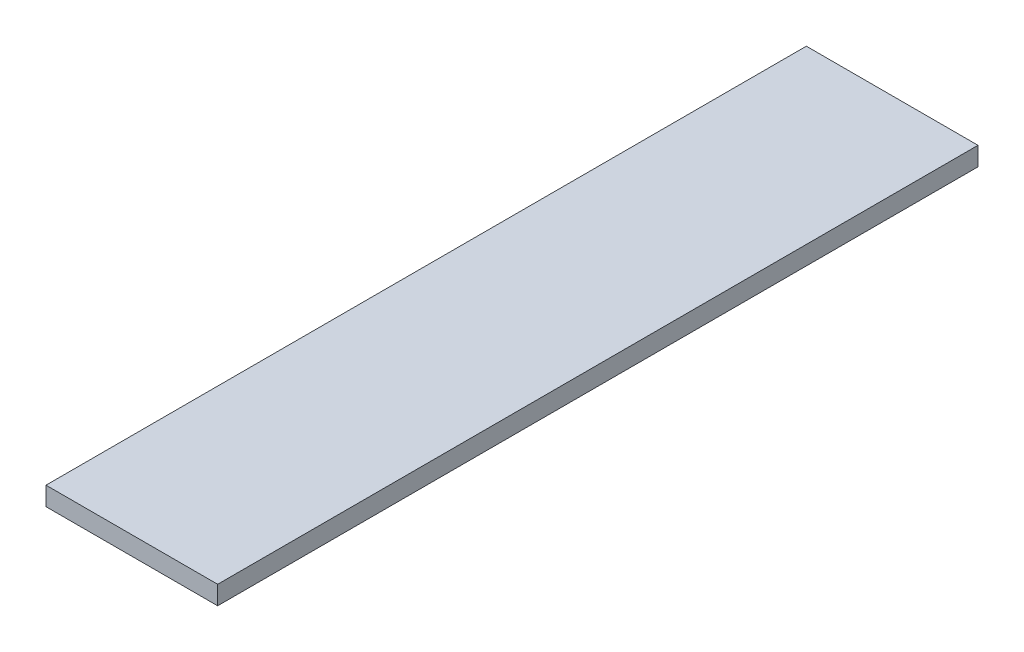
ISO-10303-21;
HEADER;
FILE_DESCRIPTION(('STEP AP214'),'2;1');
FILE_NAME('part.step','',(''),(''),'','','');
FILE_SCHEMA(('AUTOMOTIVE_DESIGN { 1 0 10303 214 1 1 1 1 }'));
ENDSEC;
DATA;
#1=APPLICATION_CONTEXT('core data for automotive mechanical design processes');
#2=APPLICATION_PROTOCOL_DEFINITION('international standard','automotive_design',2000,#1);
#3=PRODUCT_CONTEXT('',#1,'mechanical');
#4=PRODUCT('Part','Part','',(#3));
#5=PRODUCT_RELATED_PRODUCT_CATEGORY('part','',(#4));
#6=PRODUCT_DEFINITION_FORMATION('','',#4);
#7=PRODUCT_DEFINITION_CONTEXT('part definition',#1,'design');
#8=PRODUCT_DEFINITION('design','',#6,#7);
#9=PRODUCT_DEFINITION_SHAPE('','',#8);
#10=(LENGTH_UNIT() NAMED_UNIT(*) SI_UNIT(.MILLI.,.METRE.));
#11=(NAMED_UNIT(*) PLANE_ANGLE_UNIT() SI_UNIT($,.RADIAN.));
#12=(NAMED_UNIT(*) SI_UNIT($,.STERADIAN.) SOLID_ANGLE_UNIT());
#13=UNCERTAINTY_MEASURE_WITH_UNIT(LENGTH_MEASURE(1.E-05),#10,'distance_accuracy_value','');
#14=(GEOMETRIC_REPRESENTATION_CONTEXT(3) GLOBAL_UNCERTAINTY_ASSIGNED_CONTEXT((#13)) GLOBAL_UNIT_ASSIGNED_CONTEXT((#10,
#11,#12)) REPRESENTATION_CONTEXT('',''));
#15=CARTESIAN_POINT('',(0.,0.,0.));
#16=DIRECTION('',(0.,0.,1.));
#17=DIRECTION('',(1.,0.,0.));
#18=AXIS2_PLACEMENT_3D('',#15,#16,#17);
#19=CARTESIAN_POINT('',(584.199999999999,127.,-2587.67072));
#20=DIRECTION('',(-1.,0.,0.));
#21=DIRECTION('',(0.,0.,1.));
#22=AXIS2_PLACEMENT_3D('',#19,#20,#21);
#23=PLANE('',#22);
#24=DIRECTION('',(0.,0.,-1.));
#25=VECTOR('',#24,1.);
#26=CARTESIAN_POINT('',(584.199999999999,0.,-2587.67072));
#27=LINE('',#26,#25);
#28=CARTESIAN_POINT('',(584.2,0.,2587.67072));
#29=VERTEX_POINT('',#28);
#30=CARTESIAN_POINT('',(584.199999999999,0.,-2587.67072));
#31=VERTEX_POINT('',#30);
#32=EDGE_CURVE('E95',#29,#31,#27,.T.);
#33=ORIENTED_EDGE('',*,*,#32,.T.);
#34=DIRECTION('',(0.,-1.,0.));
#35=VECTOR('',#34,1.);
#36=CARTESIAN_POINT('',(584.199999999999,127.,-2587.67072));
#37=LINE('',#36,#35);
#38=CARTESIAN_POINT('',(584.199999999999,127.,-2587.67072));
#39=VERTEX_POINT('',#38);
#40=EDGE_CURVE('E11',#39,#31,#37,.T.);
#41=ORIENTED_EDGE('',*,*,#40,.F.);
#42=DIRECTION('',(0.,0.,-1.));
#43=VECTOR('',#42,1.);
#44=CARTESIAN_POINT('',(584.199999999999,127.,-2587.67072));
#45=LINE('',#44,#43);
#46=CARTESIAN_POINT('',(584.2,127.,2587.67072));
#47=VERTEX_POINT('',#46);
#48=EDGE_CURVE('E83',#47,#39,#45,.T.);
#49=ORIENTED_EDGE('',*,*,#48,.F.);
#50=DIRECTION('',(0.,-1.,0.));
#51=VECTOR('',#50,1.);
#52=CARTESIAN_POINT('',(584.2,127.,2587.67072));
#53=LINE('',#52,#51);
#54=EDGE_CURVE('E91',#47,#29,#53,.T.);
#55=ORIENTED_EDGE('',*,*,#54,.T.);
#56=EDGE_LOOP('',(#33,#41,#49,#55));
#57=FACE_BOUND('',#56,.T.);
#58=ADVANCED_FACE('F32',(#57),#23,.F.);
#59=CARTESIAN_POINT('',(-584.200000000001,127.,-2587.67072));
#60=DIRECTION('',(0.,0.,1.));
#61=DIRECTION('',(1.,0.,0.));
#62=AXIS2_PLACEMENT_3D('',#59,#60,#61);
#63=PLANE('',#62);
#64=DIRECTION('',(-1.,0.,0.));
#65=VECTOR('',#64,1.);
#66=CARTESIAN_POINT('',(-584.200000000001,0.,-2587.67072));
#67=LINE('',#66,#65);
#68=CARTESIAN_POINT('',(-584.200000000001,0.,-2587.67072));
#69=VERTEX_POINT('',#68);
#70=EDGE_CURVE('E87',#31,#69,#67,.T.);
#71=ORIENTED_EDGE('',*,*,#70,.T.);
#72=DIRECTION('',(0.,-1.,0.));
#73=VECTOR('',#72,1.);
#74=CARTESIAN_POINT('',(-584.200000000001,127.,-2587.67072));
#75=LINE('',#74,#73);
#76=CARTESIAN_POINT('',(-584.200000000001,127.,-2587.67072));
#77=VERTEX_POINT('',#76);
#78=EDGE_CURVE('E40',#77,#69,#75,.T.);
#79=ORIENTED_EDGE('',*,*,#78,.F.);
#80=DIRECTION('',(-1.,0.,0.));
#81=VECTOR('',#80,1.);
#82=CARTESIAN_POINT('',(-584.200000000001,127.,-2587.67072));
#83=LINE('',#82,#81);
#84=EDGE_CURVE('E78',#39,#77,#83,.T.);
#85=ORIENTED_EDGE('',*,*,#84,.F.);
#86=ORIENTED_EDGE('',*,*,#40,.T.);
#87=EDGE_LOOP('',(#71,#79,#85,#86));
#88=FACE_BOUND('',#87,.T.);
#89=ADVANCED_FACE('F86',(#88),#63,.F.);
#90=CARTESIAN_POINT('',(-584.200000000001,127.,-2587.67072));
#91=DIRECTION('',(1.,0.,0.));
#92=DIRECTION('',(0.,0.,-1.));
#93=AXIS2_PLACEMENT_3D('',#90,#91,#92);
#94=PLANE('',#93);
#95=DIRECTION('',(0.,0.,1.));
#96=VECTOR('',#95,1.);
#97=CARTESIAN_POINT('',(-584.200000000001,0.,-2587.67072));
#98=LINE('',#97,#96);
#99=CARTESIAN_POINT('',(-584.2,0.,2587.67072));
#100=VERTEX_POINT('',#99);
#101=EDGE_CURVE('E65',#69,#100,#98,.T.);
#102=ORIENTED_EDGE('',*,*,#101,.T.);
#103=DIRECTION('',(0.,-1.,0.));
#104=VECTOR('',#103,1.);
#105=CARTESIAN_POINT('',(-584.2,127.,2587.67072));
#106=LINE('',#105,#104);
#107=CARTESIAN_POINT('',(-584.2,127.,2587.67072));
#108=VERTEX_POINT('',#107);
#109=EDGE_CURVE('E88',#108,#100,#106,.T.);
#110=ORIENTED_EDGE('',*,*,#109,.F.);
#111=DIRECTION('',(0.,0.,1.));
#112=VECTOR('',#111,1.);
#113=CARTESIAN_POINT('',(-584.200000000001,127.,-2587.67072));
#114=LINE('',#113,#112);
#115=EDGE_CURVE('E81',#77,#108,#114,.T.);
#116=ORIENTED_EDGE('',*,*,#115,.F.);
#117=ORIENTED_EDGE('',*,*,#78,.T.);
#118=EDGE_LOOP('',(#102,#110,#116,#117));
#119=FACE_BOUND('',#118,.T.);
#120=ADVANCED_FACE('F89',(#119),#94,.F.);
#121=CARTESIAN_POINT('',(-584.2,127.,2587.67072));
#122=DIRECTION('',(0.,0.,-1.));
#123=DIRECTION('',(-1.,0.,0.));
#124=AXIS2_PLACEMENT_3D('',#121,#122,#123);
#125=PLANE('',#124);
#126=DIRECTION('',(1.,0.,0.));
#127=VECTOR('',#126,1.);
#128=CARTESIAN_POINT('',(-584.2,0.,2587.67072));
#129=LINE('',#128,#127);
#130=EDGE_CURVE('E71',#100,#29,#129,.T.);
#131=ORIENTED_EDGE('',*,*,#130,.T.);
#132=ORIENTED_EDGE('',*,*,#54,.F.);
#133=DIRECTION('',(1.,0.,0.));
#134=VECTOR('',#133,1.);
#135=CARTESIAN_POINT('',(-584.2,127.,2587.67072));
#136=LINE('',#135,#134);
#137=EDGE_CURVE('E48',#108,#47,#136,.T.);
#138=ORIENTED_EDGE('',*,*,#137,.F.);
#139=ORIENTED_EDGE('',*,*,#109,.T.);
#140=EDGE_LOOP('',(#131,#132,#138,#139));
#141=FACE_BOUND('',#140,.T.);
#142=ADVANCED_FACE('F102',(#141),#125,.F.);
#143=CARTESIAN_POINT('',(584.2,127.,2587.67072));
#144=DIRECTION('',(0.,1.,0.));
#145=DIRECTION('',(0.,0.,1.));
#146=AXIS2_PLACEMENT_3D('',#143,#144,#145);
#147=PLANE('',#146);
#148=ORIENTED_EDGE('',*,*,#48,.T.);
#149=ORIENTED_EDGE('',*,*,#84,.T.);
#150=ORIENTED_EDGE('',*,*,#115,.T.);
#151=ORIENTED_EDGE('',*,*,#137,.T.);
#152=EDGE_LOOP('',(#148,#149,#150,#151));
#153=FACE_BOUND('',#152,.T.);
#154=ADVANCED_FACE('F79',(#153),#147,.T.);
#155=CARTESIAN_POINT('',(584.2,0.,2587.67072));
#156=DIRECTION('',(0.,1.,0.));
#157=DIRECTION('',(0.,0.,1.));
#158=AXIS2_PLACEMENT_3D('',#155,#156,#157);
#159=PLANE('',#158);
#160=ORIENTED_EDGE('',*,*,#32,.F.);
#161=ORIENTED_EDGE('',*,*,#130,.F.);
#162=ORIENTED_EDGE('',*,*,#101,.F.);
#163=ORIENTED_EDGE('',*,*,#70,.F.);
#164=EDGE_LOOP('',(#160,#161,#162,#163));
#165=FACE_BOUND('',#164,.T.);
#166=ADVANCED_FACE('F105',(#165),#159,.F.);
#167=CLOSED_SHELL('',(#58,#89,#120,#142,#154,#166));
#168=MANIFOLD_SOLID_BREP('B2',#167);
#169=ADVANCED_BREP_SHAPE_REPRESENTATION('',(#18,#168),#14);
#170=SHAPE_DEFINITION_REPRESENTATION(#9,#169);
ENDSEC;
END-ISO-10303-21;
